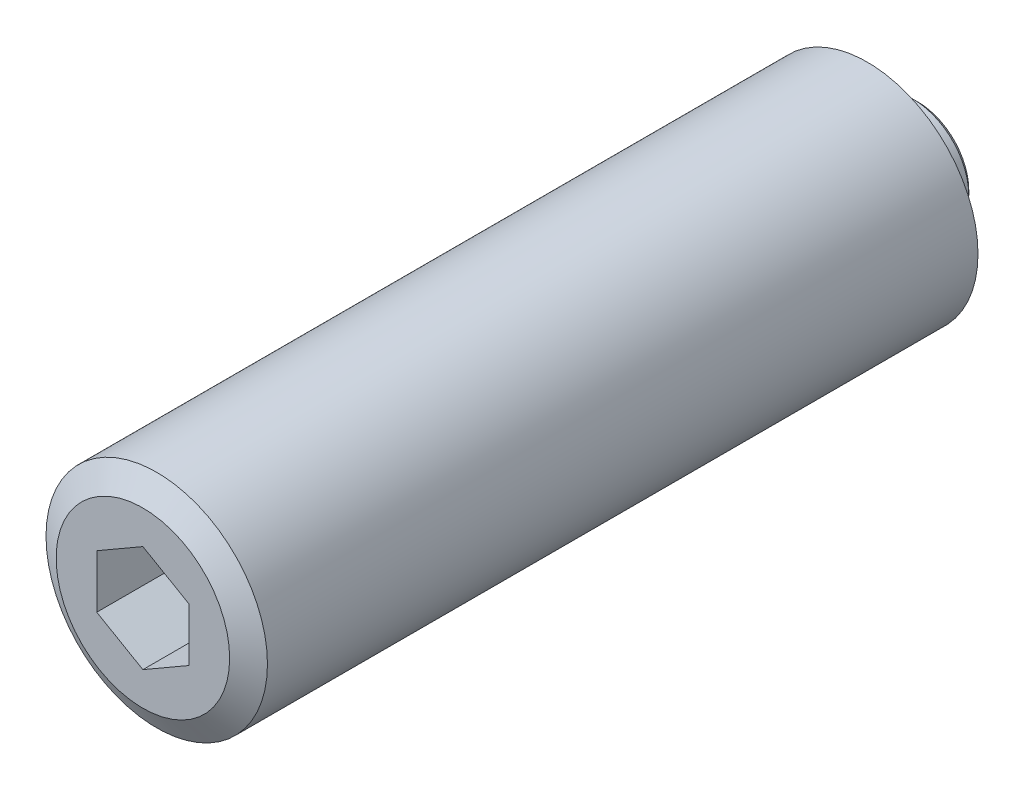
ISO-10303-21;
HEADER;
FILE_DESCRIPTION(('STEP AP214'),'2;1');
FILE_NAME('part.step','',(''),(''),'','','');
FILE_SCHEMA(('AUTOMOTIVE_DESIGN { 1 0 10303 214 1 1 1 1 }'));
ENDSEC;
DATA;
#1=APPLICATION_CONTEXT('core data for automotive mechanical design processes');
#2=APPLICATION_PROTOCOL_DEFINITION('international standard','automotive_design',2000,#1);
#3=PRODUCT_CONTEXT('',#1,'mechanical');
#4=PRODUCT('Part','Part','',(#3));
#5=PRODUCT_RELATED_PRODUCT_CATEGORY('part','',(#4));
#6=PRODUCT_DEFINITION_FORMATION('','',#4);
#7=PRODUCT_DEFINITION_CONTEXT('part definition',#1,'design');
#8=PRODUCT_DEFINITION('design','',#6,#7);
#9=PRODUCT_DEFINITION_SHAPE('','',#8);
#10=(LENGTH_UNIT() NAMED_UNIT(*) SI_UNIT(.MILLI.,.METRE.));
#11=(NAMED_UNIT(*) PLANE_ANGLE_UNIT() SI_UNIT($,.RADIAN.));
#12=(NAMED_UNIT(*) SI_UNIT($,.STERADIAN.) SOLID_ANGLE_UNIT());
#13=UNCERTAINTY_MEASURE_WITH_UNIT(LENGTH_MEASURE(1.E-05),#10,'distance_accuracy_value','');
#14=(GEOMETRIC_REPRESENTATION_CONTEXT(3) GLOBAL_UNCERTAINTY_ASSIGNED_CONTEXT((#13)) GLOBAL_UNIT_ASSIGNED_CONTEXT((#10,
#11,#12)) REPRESENTATION_CONTEXT('',''));
#15=CARTESIAN_POINT('',(0.,0.,0.));
#16=DIRECTION('',(0.,0.,1.));
#17=DIRECTION('',(1.,0.,0.));
#18=AXIS2_PLACEMENT_3D('',#15,#16,#17);
#19=CARTESIAN_POINT('',(0.,0.,0.));
#20=DIRECTION('',(0.,0.,1.));
#21=DIRECTION('',(1.,0.,0.));
#22=AXIS2_PLACEMENT_3D('',#19,#20,#21);
#23=PLANE('',#22);
#24=CARTESIAN_POINT('',(0.,0.,0.));
#25=DIRECTION('',(0.,0.,1.));
#26=DIRECTION('',(1.,0.,0.));
#27=AXIS2_PLACEMENT_3D('',#24,#25,#26);
#28=CIRCLE('',#27,5.5);
#29=CARTESIAN_POINT('',(5.5,0.,0.));
#30=VERTEX_POINT('',#29);
#31=EDGE_CURVE('E9',#30,#30,#28,.T.);
#32=ORIENTED_EDGE('',*,*,#31,.F.);
#33=EDGE_LOOP('',(#32));
#34=FACE_BOUND('',#33,.T.);
#35=ADVANCED_FACE('F14',(#34),#23,.F.);
#36=CARTESIAN_POINT('',(0.,0.,0.));
#37=DIRECTION('',(0.,0.,1.));
#38=DIRECTION('',(1.,0.,0.));
#39=AXIS2_PLACEMENT_3D('',#36,#37,#38);
#40=CONICAL_SURFACE('',#39,5.5,0.785398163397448);
#41=CARTESIAN_POINT('',(0.,0.,0.5));
#42=DIRECTION('',(0.,0.,1.));
#43=DIRECTION('',(1.,0.,0.));
#44=AXIS2_PLACEMENT_3D('',#41,#42,#43);
#45=CIRCLE('',#44,6.);
#46=CARTESIAN_POINT('',(6.,0.,0.5));
#47=VERTEX_POINT('',#46);
#48=EDGE_CURVE('E21',#47,#47,#45,.T.);
#49=ORIENTED_EDGE('',*,*,#48,.F.);
#50=EDGE_LOOP('',(#49));
#51=FACE_BOUND('',#50,.T.);
#52=ORIENTED_EDGE('',*,*,#31,.T.);
#53=EDGE_LOOP('',(#52));
#54=FACE_BOUND('',#53,.T.);
#55=ADVANCED_FACE('F145',(#51,#54),#40,.T.);
#56=CARTESIAN_POINT('',(0.,0.,88.));
#57=DIRECTION('',(0.,0.,1.));
#58=DIRECTION('',(1.,0.,0.));
#59=AXIS2_PLACEMENT_3D('',#56,#57,#58);
#60=CYLINDRICAL_SURFACE('',#59,6.);
#61=CARTESIAN_POINT('',(0.,0.,2.5999999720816));
#62=DIRECTION('',(0.,0.,1.));
#63=DIRECTION('',(1.,0.,0.));
#64=AXIS2_PLACEMENT_3D('',#61,#62,#63);
#65=CIRCLE('',#64,6.);
#66=CARTESIAN_POINT('',(6.,0.,2.5999999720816));
#67=VERTEX_POINT('',#66);
#68=EDGE_CURVE('E138',#67,#67,#65,.T.);
#69=ORIENTED_EDGE('',*,*,#68,.F.);
#70=EDGE_LOOP('',(#69));
#71=FACE_BOUND('',#70,.T.);
#72=ORIENTED_EDGE('',*,*,#48,.T.);
#73=EDGE_LOOP('',(#72));
#74=FACE_BOUND('',#73,.T.);
#75=ADVANCED_FACE('F143',(#71,#74),#60,.T.);
#76=CARTESIAN_POINT('',(0.,6.21369453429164,2.5999999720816));
#77=DIRECTION('',(0.,0.,1.));
#78=DIRECTION('',(1.,0.,0.));
#79=AXIS2_PLACEMENT_3D('',#76,#77,#78);
#80=PLANE('',#79);
#81=CARTESIAN_POINT('',(0.,0.,2.5999999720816));
#82=DIRECTION('',(0.,0.,1.));
#83=DIRECTION('',(1.,0.,0.));
#84=AXIS2_PLACEMENT_3D('',#81,#82,#83);
#85=CIRCLE('',#84,6.21369453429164);
#86=CARTESIAN_POINT('',(0.,6.21369453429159,2.5999999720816));
#87=VERTEX_POINT('',#86);
#88=EDGE_CURVE('E135',#87,#87,#85,.T.);
#89=ORIENTED_EDGE('',*,*,#88,.F.);
#90=EDGE_LOOP('',(#89));
#91=FACE_BOUND('',#90,.T.);
#92=ORIENTED_EDGE('',*,*,#68,.T.);
#93=EDGE_LOOP('',(#92));
#94=FACE_BOUND('',#93,.T.);
#95=ADVANCED_FACE('F170',(#91,#94),#80,.F.);
#96=CARTESIAN_POINT('',(0.,-1.53354676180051E-07,6.79999986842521));
#97=DIRECTION('',(0.,0.,1.));
#98=DIRECTION('',(0.,1.,0.));
#99=AXIS2_PLACEMENT_3D('',#96,#97,#98);
#100=SPHERICAL_SURFACE('',#99,7.50000005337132);
#101=CARTESIAN_POINT('',(0.,0.,3.99999985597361));
#102=DIRECTION('',(0.,0.,1.));
#103=DIRECTION('',(1.,0.,0.));
#104=AXIS2_PLACEMENT_3D('',#101,#102,#103);
#105=CIRCLE('',#104,6.95772941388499);
#106=CARTESIAN_POINT('',(0.,6.95772941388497,3.99999985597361));
#107=VERTEX_POINT('',#106);
#108=EDGE_CURVE('E132',#107,#107,#105,.T.);
#109=CARTESIAN_POINT('',(0.,6.95772941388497,3.99999985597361));
#110=CARTESIAN_POINT('',(0.,6.9515523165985,3.98465036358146));
#111=CARTESIAN_POINT('',(0.,6.9453244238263,3.96932131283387));
#112=CARTESIAN_POINT('',(0.,6.93276732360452,3.93870476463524));
#113=CARTESIAN_POINT('',(0.,6.92643811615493,3.92341726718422));
#114=CARTESIAN_POINT('',(0.,6.91367866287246,3.8928844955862));
#115=CARTESIAN_POINT('',(0.,6.90724841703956,3.87763922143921));
#116=CARTESIAN_POINT('',(0.,6.89428716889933,3.84719156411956));
#117=CARTESIAN_POINT('',(0.,6.88775616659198,3.8319891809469));
#118=CARTESIAN_POINT('',(0.,6.87459369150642,3.80162797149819));
#119=CARTESIAN_POINT('',(0.,6.86796221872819,3.78646914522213));
#120=CARTESIAN_POINT('',(0.,6.85459909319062,3.75619571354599));
#121=CARTESIAN_POINT('',(0.,6.84786744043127,3.74108110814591));
#122=CARTESIAN_POINT('',(0.,6.83430424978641,3.71089678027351));
#123=CARTESIAN_POINT('',(0.,6.82747271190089,3.6958270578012));
#124=CARTESIAN_POINT('',(0.,6.81371005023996,3.66573315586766));
#125=CARTESIAN_POINT('',(0.,6.80677892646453,3.65070897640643));
#126=CARTESIAN_POINT('',(0.,6.79281739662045,3.62070681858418));
#127=CARTESIAN_POINT('',(0.,6.78578699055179,3.60572884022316));
#128=CARTESIAN_POINT('',(0.,6.77162720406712,3.57581974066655));
#129=CARTESIAN_POINT('',(0.,6.7644978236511,3.56088861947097));
#130=CARTESIAN_POINT('',(0.,6.75014040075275,3.53107388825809));
#131=CARTESIAN_POINT('',(0.,6.7429123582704,3.51619027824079));
#132=CARTESIAN_POINT('',(0.,6.72835792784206,3.48647122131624));
#133=CARTESIAN_POINT('',(0.,6.72103153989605,3.47163577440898));
#134=CARTESIAN_POINT('',(0.,6.70628073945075,3.44201369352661));
#135=CARTESIAN_POINT('',(0.,6.69885632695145,3.42722705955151));
#136=CARTESIAN_POINT('',(0.,6.68390980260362,3.39770325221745));
#137=CARTESIAN_POINT('',(0.,6.67638769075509,3.38296607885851));
#138=CARTESIAN_POINT('',(0.,6.66124609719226,3.35354183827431));
#139=CARTESIAN_POINT('',(0.,6.65362661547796,3.33885477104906));
#140=CARTESIAN_POINT('',(0.,6.63829061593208,3.30953138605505));
#141=CARTESIAN_POINT('',(0.,6.63057409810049,3.29489506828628));
#142=CARTESIAN_POINT('',(0.,6.61504436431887,3.2656738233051));
#143=CARTESIAN_POINT('',(0.,6.60723114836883,3.25108889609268));
#144=CARTESIAN_POINT('',(0.,6.59150836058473,3.22197107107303));
#145=CARTESIAN_POINT('',(0.,6.58359878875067,3.20743817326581));
#146=CARTESIAN_POINT('',(0.,6.5676836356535,3.17842504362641));
#147=CARTESIAN_POINT('',(0.,6.55967805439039,3.16394481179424));
#148=CARTESIAN_POINT('',(0.,6.54357123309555,3.13503764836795));
#149=CARTESIAN_POINT('',(0.,6.53546999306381,3.12061071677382));
#150=CARTESIAN_POINT('',(0.,6.51917220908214,3.09181078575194));
#151=CARTESIAN_POINT('',(0.,6.5109756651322,3.07743778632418));
#152=CARTESIAN_POINT('',(0.,6.49448763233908,3.04874634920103));
#153=CARTESIAN_POINT('',(0.,6.4861961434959,3.03442791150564));
#154=CARTESIAN_POINT('',(0.,6.4695185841,3.0058462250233));
#155=CARTESIAN_POINT('',(0.,6.46113251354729,2.99158297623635));
#156=CARTESIAN_POINT('',(0.,6.44426615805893,2.96311229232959));
#157=CARTESIAN_POINT('',(0.,6.43578587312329,2.94890485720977));
#158=CARTESIAN_POINT('',(0.,6.41873146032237,2.92054642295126));
#159=CARTESIAN_POINT('',(0.,6.41015733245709,2.90639542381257));
#160=CARTESIAN_POINT('',(0.,6.39291560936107,2.87815048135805));
#161=CARTESIAN_POINT('',(0.,6.38424801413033,2.86405653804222));
#162=CARTESIAN_POINT('',(0.,6.36681973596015,2.83592632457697));
#163=CARTESIAN_POINT('',(0.,6.35805905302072,2.82189005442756));
#164=CARTESIAN_POINT('',(0.,6.34044498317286,2.79387580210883));
#165=CARTESIAN_POINT('',(0.,6.33159159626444,2.77989781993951));
#166=CARTESIAN_POINT('',(0.,6.31379250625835,2.75200075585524));
#167=CARTESIAN_POINT('',(0.,6.30484680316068,2.73808167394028));
#168=CARTESIAN_POINT('',(0.,6.28686347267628,2.71030302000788));
#169=CARTESIAN_POINT('',(0.,6.27782584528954,2.69644344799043));
#170=CARTESIAN_POINT('',(0.,6.25965906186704,2.6687844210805));
#171=CARTESIAN_POINT('',(0.,6.25052990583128,2.65498496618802));
#172=CARTESIAN_POINT('',(0.,6.23218046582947,2.62744677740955));
#173=CARTESIAN_POINT('',(0.,6.22296018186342,2.61370804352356));
#174=CARTESIAN_POINT('',(0.,6.21369453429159,2.5999999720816));
#175=B_SPLINE_CURVE_WITH_KNOTS('',3,(#109,#110,#111,#112,#113,#114,#115,#116,#117,#118,#119,
#120,#121,#122,#123,#124,#125,#126,#127,#128,#129,#130,#131,#132,#133,#134,#135,#136,#137,#138,
#139,#140,#141,#142,#143,#144,#145,#146,#147,#148,#149,#150,#151,#152,#153,#154,#155,#156,#157,
#158,#159,#160,#161,#162,#163,#164,#165,#166,#167,#168,#169,#170,#171,#172,#173,#174),
.UNSPECIFIED.,.F.,.F.,(4,2,2,2,2,2,2,2,2,2,2,2,2,2,2,2,2,2,2,2,2,2,2,2,2,2,2,2,2,2,2,2,4),(0.,
0.0496373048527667,0.0992746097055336,0.1489119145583,0.198549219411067,0.248186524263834,
0.297823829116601,0.347461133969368,0.397098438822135,0.446735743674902,0.496373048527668,
0.546010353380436,0.595647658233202,0.64528496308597,0.694922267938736,0.744559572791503,
0.79419687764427,0.843834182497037,0.893471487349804,0.94310879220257,0.992746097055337,
1.0423834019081,1.09202070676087,1.14165801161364,1.1912953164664,1.24093262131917,
1.29056992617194,1.34020723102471,1.38984453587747,1.43948184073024,1.48911914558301,
1.53875645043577,1.58839375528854),.UNSPECIFIED.);
#176=EDGE_CURVE('BSEAM179',#107,#87,#175,.T.);
#177=ORIENTED_EDGE('',*,*,#108,.F.);
#178=ORIENTED_EDGE('',*,*,#88,.T.);
#179=ORIENTED_EDGE('',*,*,#176,.T.);
#180=ORIENTED_EDGE('',*,*,#176,.F.);
#181=EDGE_LOOP('',(#177,#179,#178,#180));
#182=FACE_BOUND('',#181,.T.);
#183=ADVANCED_FACE('F179',(#182),#100,.T.);
#184=CARTESIAN_POINT('',(0.,9.401924,3.99999992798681));
#185=DIRECTION('',(0.,0.,1.));
#186=DIRECTION('',(1.,0.,0.));
#187=AXIS2_PLACEMENT_3D('',#184,#185,#186);
#188=PLANE('',#187);
#189=CARTESIAN_POINT('',(0.,0.,4.));
#190=DIRECTION('',(0.,0.,1.));
#191=DIRECTION('',(1.,0.,0.));
#192=AXIS2_PLACEMENT_3D('',#189,#190,#191);
#193=CIRCLE('',#192,9.401924);
#194=CARTESIAN_POINT('',(9.401924,0.,4.));
#195=VERTEX_POINT('',#194);
#196=EDGE_CURVE('E129',#195,#195,#193,.T.);
#197=ORIENTED_EDGE('',*,*,#196,.F.);
#198=EDGE_LOOP('',(#197));
#199=FACE_BOUND('',#198,.T.);
#200=ORIENTED_EDGE('',*,*,#108,.T.);
#201=EDGE_LOOP('',(#200));
#202=FACE_BOUND('',#201,.T.);
#203=ADVANCED_FACE('F188',(#199,#202),#188,.F.);
#204=CARTESIAN_POINT('',(0.,0.,4.));
#205=DIRECTION('',(0.,0.,1.));
#206=DIRECTION('',(1.,0.,0.));
#207=AXIS2_PLACEMENT_3D('',#204,#205,#206);
#208=CONICAL_SURFACE('',#207,9.401924,1.04719751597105);
#209=CARTESIAN_POINT('',(0.,0.,5.5));
#210=DIRECTION('',(0.,0.,1.));
#211=DIRECTION('',(1.,0.,0.));
#212=AXIS2_PLACEMENT_3D('',#209,#210,#211);
#213=CIRCLE('',#212,12.);
#214=CARTESIAN_POINT('',(12.,0.,5.5));
#215=VERTEX_POINT('',#214);
#216=EDGE_CURVE('E126',#215,#215,#213,.T.);
#217=ORIENTED_EDGE('',*,*,#216,.F.);
#218=EDGE_LOOP('',(#217));
#219=FACE_BOUND('',#218,.T.);
#220=ORIENTED_EDGE('',*,*,#196,.T.);
#221=EDGE_LOOP('',(#220));
#222=FACE_BOUND('',#221,.T.);
#223=ADVANCED_FACE('F197',(#219,#222),#208,.T.);
#224=CARTESIAN_POINT('',(0.,0.,88.));
#225=DIRECTION('',(0.,0.,1.));
#226=DIRECTION('',(1.,0.,0.));
#227=AXIS2_PLACEMENT_3D('',#224,#225,#226);
#228=CYLINDRICAL_SURFACE('',#227,12.);
#229=CARTESIAN_POINT('',(0.,0.,82.5));
#230=DIRECTION('',(0.,0.,1.));
#231=DIRECTION('',(1.,0.,0.));
#232=AXIS2_PLACEMENT_3D('',#229,#230,#231);
#233=CIRCLE('',#232,12.);
#234=CARTESIAN_POINT('',(12.,0.,82.5));
#235=VERTEX_POINT('',#234);
#236=EDGE_CURVE('E123',#235,#235,#233,.T.);
#237=ORIENTED_EDGE('',*,*,#236,.F.);
#238=EDGE_LOOP('',(#237));
#239=FACE_BOUND('',#238,.T.);
#240=ORIENTED_EDGE('',*,*,#216,.T.);
#241=EDGE_LOOP('',(#240));
#242=FACE_BOUND('',#241,.T.);
#243=ADVANCED_FACE('F206',(#239,#242),#228,.T.);
#244=CARTESIAN_POINT('',(0.,0.,82.5));
#245=DIRECTION('',(0.,0.,-1.));
#246=DIRECTION('',(-1.,0.,0.));
#247=AXIS2_PLACEMENT_3D('',#244,#245,#246);
#248=CONICAL_SURFACE('',#247,12.,1.04719751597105);
#249=CARTESIAN_POINT('',(0.,0.,84.));
#250=DIRECTION('',(0.,0.,1.));
#251=DIRECTION('',(1.,0.,0.));
#252=AXIS2_PLACEMENT_3D('',#249,#250,#251);
#253=CIRCLE('',#252,9.401924);
#254=CARTESIAN_POINT('',(9.401924,0.,84.));
#255=VERTEX_POINT('',#254);
#256=EDGE_CURVE('E115',#255,#255,#253,.T.);
#257=ORIENTED_EDGE('',*,*,#256,.F.);
#258=EDGE_LOOP('',(#257));
#259=FACE_BOUND('',#258,.T.);
#260=ORIENTED_EDGE('',*,*,#236,.T.);
#261=EDGE_LOOP('',(#260));
#262=FACE_BOUND('',#261,.T.);
#263=ADVANCED_FACE('F215',(#259,#262),#248,.T.);
#264=CARTESIAN_POINT('',(0.,9.401924,84.));
#265=DIRECTION('',(0.,0.,-1.));
#266=DIRECTION('',(-1.,0.,0.));
#267=AXIS2_PLACEMENT_3D('',#264,#265,#266);
#268=PLANE('',#267);
#269=DIRECTION('',(-0.866025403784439,-0.5,0.));
#270=VECTOR('',#269,1.);
#271=CARTESIAN_POINT('',(0.,5.77350269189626,84.));
#272=LINE('',#271,#270);
#273=CARTESIAN_POINT('',(0.,5.77350269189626,84.));
#274=VERTEX_POINT('',#273);
#275=CARTESIAN_POINT('',(-5.,2.88675134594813,84.));
#276=VERTEX_POINT('',#275);
#277=EDGE_CURVE('E102',#274,#276,#272,.T.);
#278=ORIENTED_EDGE('',*,*,#277,.F.);
#279=DIRECTION('',(-0.866025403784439,0.5,0.));
#280=VECTOR('',#279,1.);
#281=CARTESIAN_POINT('',(5.,2.88675134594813,84.));
#282=LINE('',#281,#280);
#283=CARTESIAN_POINT('',(5.,2.88675134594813,84.));
#284=VERTEX_POINT('',#283);
#285=EDGE_CURVE('E28',#284,#274,#282,.T.);
#286=ORIENTED_EDGE('',*,*,#285,.F.);
#287=DIRECTION('',(0.,1.,0.));
#288=VECTOR('',#287,1.);
#289=CARTESIAN_POINT('',(5.,-2.88675134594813,84.));
#290=LINE('',#289,#288);
#291=CARTESIAN_POINT('',(5.,-2.88675134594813,84.));
#292=VERTEX_POINT('',#291);
#293=EDGE_CURVE('E111',#292,#284,#290,.T.);
#294=ORIENTED_EDGE('',*,*,#293,.F.);
#295=DIRECTION('',(0.866025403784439,0.5,0.));
#296=VECTOR('',#295,1.);
#297=CARTESIAN_POINT('',(0.,-5.77350269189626,84.));
#298=LINE('',#297,#296);
#299=CARTESIAN_POINT('',(0.,-5.77350269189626,84.));
#300=VERTEX_POINT('',#299);
#301=EDGE_CURVE('E109',#300,#292,#298,.T.);
#302=ORIENTED_EDGE('',*,*,#301,.F.);
#303=DIRECTION('',(0.866025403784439,-0.5,0.));
#304=VECTOR('',#303,1.);
#305=CARTESIAN_POINT('',(-5.,-2.88675134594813,84.));
#306=LINE('',#305,#304);
#307=CARTESIAN_POINT('',(-5.,-2.88675134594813,84.));
#308=VERTEX_POINT('',#307);
#309=EDGE_CURVE('E76',#308,#300,#306,.T.);
#310=ORIENTED_EDGE('',*,*,#309,.F.);
#311=DIRECTION('',(0.,-1.,0.));
#312=VECTOR('',#311,1.);
#313=CARTESIAN_POINT('',(-5.,2.88675134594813,84.));
#314=LINE('',#313,#312);
#315=EDGE_CURVE('E105',#276,#308,#314,.T.);
#316=ORIENTED_EDGE('',*,*,#315,.F.);
#317=EDGE_LOOP('',(#278,#286,#294,#302,#310,#316));
#318=FACE_BOUND('',#317,.T.);
#319=ORIENTED_EDGE('',*,*,#256,.T.);
#320=EDGE_LOOP('',(#319));
#321=FACE_BOUND('',#320,.T.);
#322=ADVANCED_FACE('F224',(#318,#321),#268,.F.);
#323=CARTESIAN_POINT('',(5.,2.88675134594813,76.));
#324=DIRECTION('',(0.5,0.866025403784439,0.));
#325=DIRECTION('',(-0.866025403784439,0.5,0.));
#326=AXIS2_PLACEMENT_3D('',#323,#324,#325);
#327=PLANE('',#326);
#328=ORIENTED_EDGE('',*,*,#285,.T.);
#329=DIRECTION('',(0.,0.,1.));
#330=VECTOR('',#329,1.);
#331=CARTESIAN_POINT('',(0.,5.77350269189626,76.));
#332=LINE('',#331,#330);
#333=CARTESIAN_POINT('',(0.,5.77350269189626,76.));
#334=VERTEX_POINT('',#333);
#335=EDGE_CURVE('E58',#334,#274,#332,.T.);
#336=ORIENTED_EDGE('',*,*,#335,.F.);
#337=DIRECTION('',(-0.866025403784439,0.5,0.));
#338=VECTOR('',#337,1.);
#339=CARTESIAN_POINT('',(5.,2.88675134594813,76.));
#340=LINE('',#339,#338);
#341=CARTESIAN_POINT('',(5.,2.88675134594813,76.));
#342=VERTEX_POINT('',#341);
#343=EDGE_CURVE('E113',#342,#334,#340,.T.);
#344=ORIENTED_EDGE('',*,*,#343,.F.);
#345=DIRECTION('',(0.,0.,1.));
#346=VECTOR('',#345,1.);
#347=CARTESIAN_POINT('',(5.,2.88675134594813,76.));
#348=LINE('',#347,#346);
#349=EDGE_CURVE('E36',#342,#284,#348,.T.);
#350=ORIENTED_EDGE('',*,*,#349,.T.);
#351=EDGE_LOOP('',(#328,#336,#344,#350));
#352=FACE_BOUND('',#351,.T.);
#353=ADVANCED_FACE('F233',(#352),#327,.F.);
#354=CARTESIAN_POINT('',(5.,-2.88675134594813,76.));
#355=DIRECTION('',(1.,0.,0.));
#356=DIRECTION('',(0.,0.,-1.));
#357=AXIS2_PLACEMENT_3D('',#354,#355,#356);
#358=PLANE('',#357);
#359=ORIENTED_EDGE('',*,*,#293,.T.);
#360=ORIENTED_EDGE('',*,*,#349,.F.);
#361=DIRECTION('',(0.,1.,0.));
#362=VECTOR('',#361,1.);
#363=CARTESIAN_POINT('',(5.,-2.88675134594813,76.));
#364=LINE('',#363,#362);
#365=CARTESIAN_POINT('',(5.,-2.88675134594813,76.));
#366=VERTEX_POINT('',#365);
#367=EDGE_CURVE('E88',#366,#342,#364,.T.);
#368=ORIENTED_EDGE('',*,*,#367,.F.);
#369=DIRECTION('',(0.,0.,1.));
#370=VECTOR('',#369,1.);
#371=CARTESIAN_POINT('',(5.,-2.88675134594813,76.));
#372=LINE('',#371,#370);
#373=EDGE_CURVE('E80',#366,#292,#372,.T.);
#374=ORIENTED_EDGE('',*,*,#373,.T.);
#375=EDGE_LOOP('',(#359,#360,#368,#374));
#376=FACE_BOUND('',#375,.T.);
#377=ADVANCED_FACE('F242',(#376),#358,.F.);
#378=CARTESIAN_POINT('',(0.,-5.77350269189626,76.));
#379=DIRECTION('',(0.5,-0.866025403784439,0.));
#380=DIRECTION('',(0.866025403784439,0.5,0.));
#381=AXIS2_PLACEMENT_3D('',#378,#379,#380);
#382=PLANE('',#381);
#383=ORIENTED_EDGE('',*,*,#301,.T.);
#384=ORIENTED_EDGE('',*,*,#373,.F.);
#385=DIRECTION('',(0.866025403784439,0.5,0.));
#386=VECTOR('',#385,1.);
#387=CARTESIAN_POINT('',(0.,-5.77350269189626,76.));
#388=LINE('',#387,#386);
#389=CARTESIAN_POINT('',(0.,-5.77350269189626,76.));
#390=VERTEX_POINT('',#389);
#391=EDGE_CURVE('E84',#390,#366,#388,.T.);
#392=ORIENTED_EDGE('',*,*,#391,.F.);
#393=DIRECTION('',(0.,0.,1.));
#394=VECTOR('',#393,1.);
#395=CARTESIAN_POINT('',(0.,-5.77350269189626,76.));
#396=LINE('',#395,#394);
#397=EDGE_CURVE('E69',#390,#300,#396,.T.);
#398=ORIENTED_EDGE('',*,*,#397,.T.);
#399=EDGE_LOOP('',(#383,#384,#392,#398));
#400=FACE_BOUND('',#399,.T.);
#401=ADVANCED_FACE('F85',(#400),#382,.F.);
#402=CARTESIAN_POINT('',(-5.,-2.88675134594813,76.));
#403=DIRECTION('',(-0.5,-0.866025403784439,0.));
#404=DIRECTION('',(0.866025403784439,-0.5,0.));
#405=AXIS2_PLACEMENT_3D('',#402,#403,#404);
#406=PLANE('',#405);
#407=ORIENTED_EDGE('',*,*,#309,.T.);
#408=ORIENTED_EDGE('',*,*,#397,.F.);
#409=DIRECTION('',(0.866025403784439,-0.5,0.));
#410=VECTOR('',#409,1.);
#411=CARTESIAN_POINT('',(-5.,-2.88675134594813,76.));
#412=LINE('',#411,#410);
#413=CARTESIAN_POINT('',(-5.,-2.88675134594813,76.));
#414=VERTEX_POINT('',#413);
#415=EDGE_CURVE('E73',#414,#390,#412,.T.);
#416=ORIENTED_EDGE('',*,*,#415,.F.);
#417=DIRECTION('',(0.,0.,1.));
#418=VECTOR('',#417,1.);
#419=CARTESIAN_POINT('',(-5.,-2.88675134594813,76.));
#420=LINE('',#419,#418);
#421=EDGE_CURVE('E81',#414,#308,#420,.T.);
#422=ORIENTED_EDGE('',*,*,#421,.T.);
#423=EDGE_LOOP('',(#407,#408,#416,#422));
#424=FACE_BOUND('',#423,.T.);
#425=ADVANCED_FACE('F71',(#424),#406,.F.);
#426=CARTESIAN_POINT('',(-5.,2.88675134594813,76.));
#427=DIRECTION('',(-1.,0.,0.));
#428=DIRECTION('',(0.,0.,1.));
#429=AXIS2_PLACEMENT_3D('',#426,#427,#428);
#430=PLANE('',#429);
#431=ORIENTED_EDGE('',*,*,#315,.T.);
#432=ORIENTED_EDGE('',*,*,#421,.F.);
#433=DIRECTION('',(0.,-1.,0.));
#434=VECTOR('',#433,1.);
#435=CARTESIAN_POINT('',(-5.,2.88675134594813,76.));
#436=LINE('',#435,#434);
#437=CARTESIAN_POINT('',(-5.,2.88675134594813,76.));
#438=VERTEX_POINT('',#437);
#439=EDGE_CURVE('E94',#438,#414,#436,.T.);
#440=ORIENTED_EDGE('',*,*,#439,.F.);
#441=DIRECTION('',(0.,0.,1.));
#442=VECTOR('',#441,1.);
#443=CARTESIAN_POINT('',(-5.,2.88675134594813,76.));
#444=LINE('',#443,#442);
#445=EDGE_CURVE('E118',#438,#276,#444,.T.);
#446=ORIENTED_EDGE('',*,*,#445,.T.);
#447=EDGE_LOOP('',(#431,#432,#440,#446));
#448=FACE_BOUND('',#447,.T.);
#449=ADVANCED_FACE('F264',(#448),#430,.F.);
#450=CARTESIAN_POINT('',(0.,5.77350269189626,76.));
#451=DIRECTION('',(-0.5,0.866025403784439,0.));
#452=DIRECTION('',(-0.866025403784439,-0.5,0.));
#453=AXIS2_PLACEMENT_3D('',#450,#451,#452);
#454=PLANE('',#453);
#455=ORIENTED_EDGE('',*,*,#277,.T.);
#456=ORIENTED_EDGE('',*,*,#445,.F.);
#457=DIRECTION('',(-0.866025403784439,-0.5,0.));
#458=VECTOR('',#457,1.);
#459=CARTESIAN_POINT('',(0.,5.77350269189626,76.));
#460=LINE('',#459,#458);
#461=EDGE_CURVE('E96',#334,#438,#460,.T.);
#462=ORIENTED_EDGE('',*,*,#461,.F.);
#463=ORIENTED_EDGE('',*,*,#335,.T.);
#464=EDGE_LOOP('',(#455,#456,#462,#463));
#465=FACE_BOUND('',#464,.T.);
#466=ADVANCED_FACE('F272',(#465),#454,.F.);
#467=CARTESIAN_POINT('',(0.,5.77350269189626,76.));
#468=DIRECTION('',(0.,0.,1.));
#469=DIRECTION('',(1.,0.,0.));
#470=AXIS2_PLACEMENT_3D('',#467,#468,#469);
#471=PLANE('',#470);
#472=ORIENTED_EDGE('',*,*,#343,.T.);
#473=ORIENTED_EDGE('',*,*,#461,.T.);
#474=ORIENTED_EDGE('',*,*,#439,.T.);
#475=ORIENTED_EDGE('',*,*,#415,.T.);
#476=ORIENTED_EDGE('',*,*,#391,.T.);
#477=ORIENTED_EDGE('',*,*,#367,.T.);
#478=EDGE_LOOP('',(#472,#473,#474,#475,#476,#477));
#479=FACE_BOUND('',#478,.T.);
#480=ADVANCED_FACE('F91',(#479),#471,.T.);
#481=CLOSED_SHELL('',(#35,#55,#75,#95,#183,#203,#223,#243,#263,#322,#353,#377,#401,#425,#449,
#466,#480));
#482=MANIFOLD_SOLID_BREP('B1',#481);
#483=ADVANCED_BREP_SHAPE_REPRESENTATION('',(#18,#482),#14);
#484=SHAPE_DEFINITION_REPRESENTATION(#9,#483);
ENDSEC;
END-ISO-10303-21;
